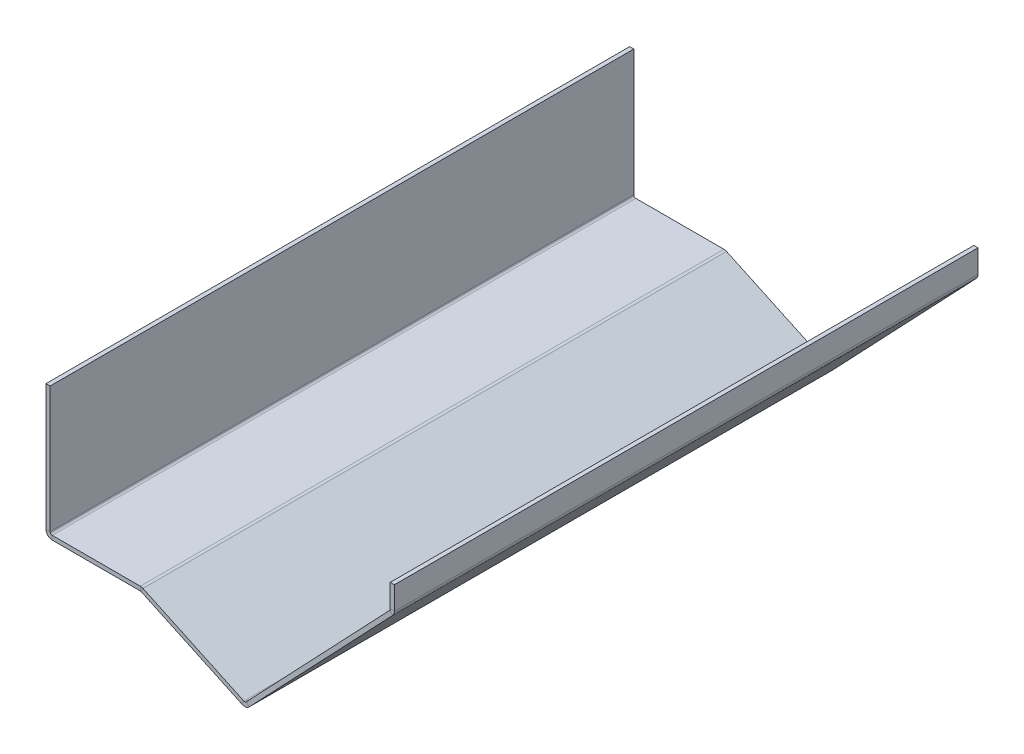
ISO-10303-21;
HEADER;
FILE_DESCRIPTION(('STEP AP214'),'2;1');
FILE_NAME('part.step','',(''),(''),'','','');
FILE_SCHEMA(('AUTOMOTIVE_DESIGN { 1 0 10303 214 1 1 1 1 }'));
ENDSEC;
DATA;
#1=APPLICATION_CONTEXT('core data for automotive mechanical design processes');
#2=APPLICATION_PROTOCOL_DEFINITION('international standard','automotive_design',2000,#1);
#3=PRODUCT_CONTEXT('',#1,'mechanical');
#4=PRODUCT('Part','Part','',(#3));
#5=PRODUCT_RELATED_PRODUCT_CATEGORY('part','',(#4));
#6=PRODUCT_DEFINITION_FORMATION('','',#4);
#7=PRODUCT_DEFINITION_CONTEXT('part definition',#1,'design');
#8=PRODUCT_DEFINITION('design','',#6,#7);
#9=PRODUCT_DEFINITION_SHAPE('','',#8);
#10=(LENGTH_UNIT() NAMED_UNIT(*) SI_UNIT(.MILLI.,.METRE.));
#11=(NAMED_UNIT(*) PLANE_ANGLE_UNIT() SI_UNIT($,.RADIAN.));
#12=(NAMED_UNIT(*) SI_UNIT($,.STERADIAN.) SOLID_ANGLE_UNIT());
#13=UNCERTAINTY_MEASURE_WITH_UNIT(LENGTH_MEASURE(1.E-05),#10,'distance_accuracy_value','');
#14=(GEOMETRIC_REPRESENTATION_CONTEXT(3) GLOBAL_UNCERTAINTY_ASSIGNED_CONTEXT((#13)) GLOBAL_UNIT_ASSIGNED_CONTEXT((#10,
#11,#12)) REPRESENTATION_CONTEXT('',''));
#15=CARTESIAN_POINT('',(0.,0.,0.));
#16=DIRECTION('',(0.,0.,1.));
#17=DIRECTION('',(1.,0.,0.));
#18=AXIS2_PLACEMENT_3D('',#15,#16,#17);
#19=CARTESIAN_POINT('',(1.,0.,281.5));
#20=DIRECTION('',(0.,0.,1.));
#21=DIRECTION('',(1.,0.,0.));
#22=AXIS2_PLACEMENT_3D('',#19,#20,#21);
#23=PLANE('',#22);
#24=DIRECTION('',(0.,-1.,0.));
#25=VECTOR('',#24,1.);
#26=CARTESIAN_POINT('',(1.,0.,281.5));
#27=LINE('',#26,#25);
#28=CARTESIAN_POINT('',(1.,0.,281.5));
#29=VERTEX_POINT('',#28);
#30=CARTESIAN_POINT('',(1.,-2.,281.5));
#31=VERTEX_POINT('',#30);
#32=EDGE_CURVE('E11',#29,#31,#27,.T.);
#33=ORIENTED_EDGE('',*,*,#32,.F.);
#34=CARTESIAN_POINT('',(1.,1.,281.5));
#35=DIRECTION('',(0.,0.,-1.));
#36=DIRECTION('',(-1.,0.,0.));
#37=AXIS2_PLACEMENT_3D('',#34,#35,#36);
#38=CIRCLE('',#37,1.);
#39=CARTESIAN_POINT('',(0.,1.,281.5));
#40=VERTEX_POINT('',#39);
#41=EDGE_CURVE('E364',#40,#29,#38,.F.);
#42=ORIENTED_EDGE('',*,*,#41,.F.);
#43=DIRECTION('',(1.,0.,0.));
#44=VECTOR('',#43,1.);
#45=CARTESIAN_POINT('',(-2.,1.,281.5));
#46=LINE('',#45,#44);
#47=CARTESIAN_POINT('',(-2.,1.,281.5));
#48=VERTEX_POINT('',#47);
#49=EDGE_CURVE('E43',#48,#40,#46,.T.);
#50=ORIENTED_EDGE('',*,*,#49,.F.);
#51=CARTESIAN_POINT('',(1.,1.,281.5));
#52=DIRECTION('',(0.,0.,1.));
#53=DIRECTION('',(1.,0.,0.));
#54=AXIS2_PLACEMENT_3D('',#51,#52,#53);
#55=CIRCLE('',#54,3.);
#56=EDGE_CURVE('E377',#48,#31,#55,.T.);
#57=ORIENTED_EDGE('',*,*,#56,.T.);
#58=EDGE_LOOP('',(#33,#42,#50,#57));
#59=FACE_BOUND('',#58,.T.);
#60=ADVANCED_FACE('F35',(#59),#23,.T.);
#61=CARTESIAN_POINT('',(-2.,1.,281.5));
#62=DIRECTION('',(0.,0.,1.));
#63=DIRECTION('',(1.,0.,0.));
#64=AXIS2_PLACEMENT_3D('',#61,#62,#63);
#65=PLANE('',#64);
#66=DIRECTION('',(1.,0.,0.));
#67=VECTOR('',#66,1.);
#68=CARTESIAN_POINT('',(0.,0.,281.5));
#69=LINE('',#68,#67);
#70=CARTESIAN_POINT('',(43.4847709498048,0.,281.5));
#71=VERTEX_POINT('',#70);
#72=EDGE_CURVE('E368',#29,#71,#69,.T.);
#73=ORIENTED_EDGE('',*,*,#72,.F.);
#74=ORIENTED_EDGE('',*,*,#32,.T.);
#75=DIRECTION('',(1.,0.,0.));
#76=VECTOR('',#75,1.);
#77=CARTESIAN_POINT('',(0.,-2.,281.5));
#78=LINE('',#77,#76);
#79=CARTESIAN_POINT('',(43.4847709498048,-2.,281.5));
#80=VERTEX_POINT('',#79);
#81=EDGE_CURVE('E379',#31,#80,#78,.T.);
#82=ORIENTED_EDGE('',*,*,#81,.T.);
#83=DIRECTION('',(0.,1.,0.));
#84=VECTOR('',#83,1.);
#85=CARTESIAN_POINT('',(43.4847709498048,-2.,281.5));
#86=LINE('',#85,#84);
#87=EDGE_CURVE('E338',#80,#71,#86,.T.);
#88=ORIENTED_EDGE('',*,*,#87,.T.);
#89=EDGE_LOOP('',(#73,#74,#82,#88));
#90=FACE_BOUND('',#89,.T.);
#91=ADVANCED_FACE('F448',(#90),#65,.T.);
#92=CARTESIAN_POINT('',(0.,1.,0.));
#93=DIRECTION('',(0.,0.,-1.));
#94=DIRECTION('',(-1.,0.,0.));
#95=AXIS2_PLACEMENT_3D('',#92,#93,#94);
#96=PLANE('',#95);
#97=DIRECTION('',(-1.,0.,0.));
#98=VECTOR('',#97,1.);
#99=CARTESIAN_POINT('',(0.,1.,0.));
#100=LINE('',#99,#98);
#101=CARTESIAN_POINT('',(0.,1.,0.));
#102=VERTEX_POINT('',#101);
#103=CARTESIAN_POINT('',(-2.,1.,0.));
#104=VERTEX_POINT('',#103);
#105=EDGE_CURVE('E344',#102,#104,#100,.T.);
#106=ORIENTED_EDGE('',*,*,#105,.F.);
#107=CARTESIAN_POINT('',(1.,1.,0.));
#108=DIRECTION('',(0.,0.,-1.));
#109=DIRECTION('',(-1.,0.,0.));
#110=AXIS2_PLACEMENT_3D('',#107,#108,#109);
#111=CIRCLE('',#110,1.);
#112=CARTESIAN_POINT('',(1.,0.,0.));
#113=VERTEX_POINT('',#112);
#114=EDGE_CURVE('E248',#102,#113,#111,.F.);
#115=ORIENTED_EDGE('',*,*,#114,.T.);
#116=DIRECTION('',(0.,1.,0.));
#117=VECTOR('',#116,1.);
#118=CARTESIAN_POINT('',(1.,-2.,0.));
#119=LINE('',#118,#117);
#120=CARTESIAN_POINT('',(1.,-2.,0.));
#121=VERTEX_POINT('',#120);
#122=EDGE_CURVE('E342',#121,#113,#119,.T.);
#123=ORIENTED_EDGE('',*,*,#122,.F.);
#124=CARTESIAN_POINT('',(1.,1.,0.));
#125=DIRECTION('',(0.,0.,1.));
#126=DIRECTION('',(1.,0.,0.));
#127=AXIS2_PLACEMENT_3D('',#124,#125,#126);
#128=CIRCLE('',#127,3.);
#129=EDGE_CURVE('E260',#104,#121,#128,.T.);
#130=ORIENTED_EDGE('',*,*,#129,.F.);
#131=EDGE_LOOP('',(#106,#115,#123,#130));
#132=FACE_BOUND('',#131,.T.);
#133=ADVANCED_FACE('F490',(#132),#96,.T.);
#134=CARTESIAN_POINT('',(1.,-2.,0.));
#135=DIRECTION('',(0.,0.,-1.));
#136=DIRECTION('',(-1.,0.,0.));
#137=AXIS2_PLACEMENT_3D('',#134,#135,#136);
#138=PLANE('',#137);
#139=DIRECTION('',(0.,-1.,0.));
#140=VECTOR('',#139,1.);
#141=CARTESIAN_POINT('',(0.,61.8874884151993,0.));
#142=LINE('',#141,#140);
#143=CARTESIAN_POINT('',(0.,61.8874884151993,0.));
#144=VERTEX_POINT('',#143);
#145=EDGE_CURVE('E251',#144,#102,#142,.T.);
#146=ORIENTED_EDGE('',*,*,#145,.T.);
#147=ORIENTED_EDGE('',*,*,#105,.T.);
#148=DIRECTION('',(0.,1.,0.));
#149=VECTOR('',#148,1.);
#150=CARTESIAN_POINT('',(-2.,61.8874884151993,0.));
#151=LINE('',#150,#149);
#152=CARTESIAN_POINT('',(-2.,61.8874884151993,0.));
#153=VERTEX_POINT('',#152);
#154=EDGE_CURVE('E257',#153,#104,#151,.F.);
#155=ORIENTED_EDGE('',*,*,#154,.F.);
#156=DIRECTION('',(1.,0.,0.));
#157=VECTOR('',#156,1.);
#158=CARTESIAN_POINT('',(-2.,61.8874884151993,0.));
#159=LINE('',#158,#157);
#160=EDGE_CURVE('E254',#153,#144,#159,.T.);
#161=ORIENTED_EDGE('',*,*,#160,.T.);
#162=EDGE_LOOP('',(#146,#147,#155,#161));
#163=FACE_BOUND('',#162,.T.);
#164=ADVANCED_FACE('F494',(#163),#138,.T.);
#165=CARTESIAN_POINT('',(44.7526361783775,-0.281081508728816,281.5));
#166=DIRECTION('',(0.,0.,1.));
#167=DIRECTION('',(1.,0.,0.));
#168=AXIS2_PLACEMENT_3D('',#165,#166,#167);
#169=PLANE('',#168);
#170=DIRECTION('',(-0.422621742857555,-0.906306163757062,0.));
#171=VECTOR('',#170,1.);
#172=CARTESIAN_POINT('',(44.7526361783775,-0.281081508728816,281.5));
#173=LINE('',#172,#171);
#174=CARTESIAN_POINT('',(44.7526361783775,-0.281081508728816,281.5));
#175=VERTEX_POINT('',#174);
#176=CARTESIAN_POINT('',(43.9073926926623,-2.09369383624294,281.5));
#177=VERTEX_POINT('',#176);
#178=EDGE_CURVE('E340',#175,#177,#173,.T.);
#179=ORIENTED_EDGE('',*,*,#178,.F.);
#180=CARTESIAN_POINT('',(43.4847709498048,-3.,281.5));
#181=DIRECTION('',(0.,0.,1.));
#182=DIRECTION('',(1.,0.,0.));
#183=AXIS2_PLACEMENT_3D('',#180,#181,#182);
#184=CIRCLE('',#183,3.);
#185=EDGE_CURVE('E438',#71,#175,#184,.F.);
#186=ORIENTED_EDGE('',*,*,#185,.F.);
#187=ORIENTED_EDGE('',*,*,#87,.F.);
#188=CARTESIAN_POINT('',(43.4847709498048,-3.,281.5));
#189=DIRECTION('',(0.,0.,1.));
#190=DIRECTION('',(1.,0.,0.));
#191=AXIS2_PLACEMENT_3D('',#188,#189,#190);
#192=CIRCLE('',#191,1.);
#193=EDGE_CURVE('E382',#80,#177,#192,.F.);
#194=ORIENTED_EDGE('',*,*,#193,.T.);
#195=EDGE_LOOP('',(#179,#186,#187,#194));
#196=FACE_BOUND('',#195,.T.);
#197=ADVANCED_FACE('F455',(#196),#169,.T.);
#198=CARTESIAN_POINT('',(43.4847709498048,-2.,281.5));
#199=DIRECTION('',(0.,0.,1.));
#200=DIRECTION('',(1.,0.,0.));
#201=AXIS2_PLACEMENT_3D('',#198,#199,#200);
#202=PLANE('',#201);
#203=DIRECTION('',(0.906306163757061,-0.422621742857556,0.));
#204=VECTOR('',#203,1.);
#205=CARTESIAN_POINT('',(44.1498609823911,0.,281.5));
#206=LINE('',#205,#204);
#207=CARTESIAN_POINT('',(93.4389456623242,-22.9841081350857,281.5));
#208=VERTEX_POINT('',#207);
#209=EDGE_CURVE('E435',#175,#208,#206,.T.);
#210=ORIENTED_EDGE('',*,*,#209,.F.);
#211=ORIENTED_EDGE('',*,*,#178,.T.);
#212=DIRECTION('',(0.906306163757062,-0.422621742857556,0.));
#213=VECTOR('',#212,1.);
#214=CARTESIAN_POINT('',(43.304617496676,-1.81261232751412,281.5));
#215=LINE('',#214,#213);
#216=CARTESIAN_POINT('',(92.5937021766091,-24.7967204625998,281.5));
#217=VERTEX_POINT('',#216);
#218=EDGE_CURVE('E202',#177,#217,#215,.T.);
#219=ORIENTED_EDGE('',*,*,#218,.T.);
#220=DIRECTION('',(0.422621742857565,0.906306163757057,0.));
#221=VECTOR('',#220,1.);
#222=CARTESIAN_POINT('',(92.5937021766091,-24.7967204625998,281.5));
#223=LINE('',#222,#221);
#224=EDGE_CURVE('E193',#217,#208,#223,.T.);
#225=ORIENTED_EDGE('',*,*,#224,.T.);
#226=EDGE_LOOP('',(#210,#211,#219,#225));
#227=FACE_BOUND('',#226,.T.);
#228=ADVANCED_FACE('F388',(#227),#202,.T.);
#229=CARTESIAN_POINT('',(43.4847709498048,0.,0.));
#230=DIRECTION('',(0.,0.,-1.));
#231=DIRECTION('',(-1.,0.,0.));
#232=AXIS2_PLACEMENT_3D('',#229,#230,#231);
#233=PLANE('',#232);
#234=DIRECTION('',(0.,-1.,0.));
#235=VECTOR('',#234,1.);
#236=CARTESIAN_POINT('',(43.4847709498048,0.,0.));
#237=LINE('',#236,#235);
#238=CARTESIAN_POINT('',(43.4847709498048,0.,0.));
#239=VERTEX_POINT('',#238);
#240=CARTESIAN_POINT('',(43.4847709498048,-2.,0.));
#241=VERTEX_POINT('',#240);
#242=EDGE_CURVE('E336',#239,#241,#237,.T.);
#243=ORIENTED_EDGE('',*,*,#242,.F.);
#244=CARTESIAN_POINT('',(43.4847709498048,-3.,0.));
#245=DIRECTION('',(0.,0.,1.));
#246=DIRECTION('',(1.,0.,0.));
#247=AXIS2_PLACEMENT_3D('',#244,#245,#246);
#248=CIRCLE('',#247,3.);
#249=CARTESIAN_POINT('',(44.7526361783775,-0.281081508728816,0.));
#250=VERTEX_POINT('',#249);
#251=EDGE_CURVE('E242',#239,#250,#248,.F.);
#252=ORIENTED_EDGE('',*,*,#251,.T.);
#253=DIRECTION('',(0.422621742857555,0.906306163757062,0.));
#254=VECTOR('',#253,1.);
#255=CARTESIAN_POINT('',(43.9073926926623,-2.09369383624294,0.));
#256=LINE('',#255,#254);
#257=CARTESIAN_POINT('',(43.9073926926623,-2.09369383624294,0.));
#258=VERTEX_POINT('',#257);
#259=EDGE_CURVE('E192',#258,#250,#256,.T.);
#260=ORIENTED_EDGE('',*,*,#259,.F.);
#261=CARTESIAN_POINT('',(43.4847709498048,-3.,0.));
#262=DIRECTION('',(0.,0.,1.));
#263=DIRECTION('',(1.,0.,0.));
#264=AXIS2_PLACEMENT_3D('',#261,#262,#263);
#265=CIRCLE('',#264,1.);
#266=EDGE_CURVE('E266',#241,#258,#265,.F.);
#267=ORIENTED_EDGE('',*,*,#266,.F.);
#268=EDGE_LOOP('',(#243,#252,#260,#267));
#269=FACE_BOUND('',#268,.T.);
#270=ADVANCED_FACE('F464',(#269),#233,.T.);
#271=CARTESIAN_POINT('',(43.9073926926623,-2.09369383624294,0.));
#272=DIRECTION('',(0.,0.,-1.));
#273=DIRECTION('',(-1.,0.,0.));
#274=AXIS2_PLACEMENT_3D('',#271,#272,#273);
#275=PLANE('',#274);
#276=DIRECTION('',(1.,0.,0.));
#277=VECTOR('',#276,1.);
#278=CARTESIAN_POINT('',(0.,0.,0.));
#279=LINE('',#278,#277);
#280=EDGE_CURVE('E245',#113,#239,#279,.T.);
#281=ORIENTED_EDGE('',*,*,#280,.T.);
#282=ORIENTED_EDGE('',*,*,#242,.T.);
#283=DIRECTION('',(1.,0.,0.));
#284=VECTOR('',#283,1.);
#285=CARTESIAN_POINT('',(0.,-2.,0.));
#286=LINE('',#285,#284);
#287=EDGE_CURVE('E263',#121,#241,#286,.T.);
#288=ORIENTED_EDGE('',*,*,#287,.F.);
#289=ORIENTED_EDGE('',*,*,#122,.T.);
#290=EDGE_LOOP('',(#281,#282,#288,#289));
#291=FACE_BOUND('',#290,.T.);
#292=ADVANCED_FACE('F468',(#291),#275,.T.);
#293=CARTESIAN_POINT('',(94.5865103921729,-22.7666108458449,281.5));
#294=DIRECTION('',(0.,0.,1.));
#295=DIRECTION('',(1.,0.,0.));
#296=AXIS2_PLACEMENT_3D('',#293,#294,#295);
#297=PLANE('',#296);
#298=DIRECTION('',(0.72494298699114,-0.688808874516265,0.));
#299=VECTOR('',#298,1.);
#300=CARTESIAN_POINT('',(94.5865103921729,-22.7666108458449,281.5));
#301=LINE('',#300,#299);
#302=CARTESIAN_POINT('',(94.5865103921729,-22.7666108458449,281.5));
#303=VERTEX_POINT('',#302);
#304=CARTESIAN_POINT('',(96.0363963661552,-24.1442285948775,281.5));
#305=VERTEX_POINT('',#304);
#306=EDGE_CURVE('E180',#303,#305,#301,.T.);
#307=ORIENTED_EDGE('',*,*,#306,.F.);
#308=CARTESIAN_POINT('',(93.8615674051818,-22.0778019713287,281.5));
#309=DIRECTION('',(0.,0.,-1.));
#310=DIRECTION('',(-1.,0.,0.));
#311=AXIS2_PLACEMENT_3D('',#308,#309,#310);
#312=CIRCLE('',#311,1.);
#313=EDGE_CURVE('E400',#208,#303,#312,.F.);
#314=ORIENTED_EDGE('',*,*,#313,.F.);
#315=ORIENTED_EDGE('',*,*,#224,.F.);
#316=CARTESIAN_POINT('',(93.8615674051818,-22.0778019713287,281.5));
#317=DIRECTION('',(0.,0.,1.));
#318=DIRECTION('',(1.,0.,0.));
#319=AXIS2_PLACEMENT_3D('',#316,#317,#318);
#320=CIRCLE('',#319,3.);
#321=EDGE_CURVE('E196',#217,#305,#320,.T.);
#322=ORIENTED_EDGE('',*,*,#321,.T.);
#323=EDGE_LOOP('',(#307,#314,#315,#322));
#324=FACE_BOUND('',#323,.T.);
#325=ADVANCED_FACE('F198',(#324),#297,.T.);
#326=CARTESIAN_POINT('',(92.5937021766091,-24.7967204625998,281.5));
#327=DIRECTION('',(0.,0.,1.));
#328=DIRECTION('',(1.,0.,0.));
#329=AXIS2_PLACEMENT_3D('',#326,#327,#328);
#330=PLANE('',#329);
#331=DIRECTION('',(0.688808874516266,0.724942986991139,0.));
#332=VECTOR('',#331,1.);
#333=CARTESIAN_POINT('',(94.0909644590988,-23.2881525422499,281.5));
#334=LINE('',#333,#332);
#335=CARTESIAN_POINT('',(163.766193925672,50.0421584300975,281.5));
#336=VERTEX_POINT('',#335);
#337=EDGE_CURVE('E187',#303,#336,#334,.T.);
#338=ORIENTED_EDGE('',*,*,#337,.F.);
#339=ORIENTED_EDGE('',*,*,#306,.T.);
#340=DIRECTION('',(0.688808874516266,0.724942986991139,0.));
#341=VECTOR('',#340,1.);
#342=CARTESIAN_POINT('',(95.5408504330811,-24.6657702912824,281.5));
#343=LINE('',#342,#341);
#344=CARTESIAN_POINT('',(165.216079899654,48.664540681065,281.5));
#345=VERTEX_POINT('',#344);
#346=EDGE_CURVE('E184',#305,#345,#343,.T.);
#347=ORIENTED_EDGE('',*,*,#346,.T.);
#348=DIRECTION('',(-0.724942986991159,0.688808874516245,0.));
#349=VECTOR('',#348,1.);
#350=CARTESIAN_POINT('',(165.216079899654,48.664540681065,281.5));
#351=LINE('',#350,#349);
#352=EDGE_CURVE('E327',#345,#336,#351,.T.);
#353=ORIENTED_EDGE('',*,*,#352,.T.);
#354=EDGE_LOOP('',(#338,#339,#347,#353));
#355=FACE_BOUND('',#354,.T.);
#356=ADVANCED_FACE('F182',(#355),#330,.T.);
#357=CARTESIAN_POINT('',(93.4389456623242,-22.9841081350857,0.));
#358=DIRECTION('',(0.,0.,-1.));
#359=DIRECTION('',(-1.,0.,0.));
#360=AXIS2_PLACEMENT_3D('',#357,#358,#359);
#361=PLANE('',#360);
#362=DIRECTION('',(-0.422621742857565,-0.906306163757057,0.));
#363=VECTOR('',#362,1.);
#364=CARTESIAN_POINT('',(93.4389456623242,-22.9841081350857,0.));
#365=LINE('',#364,#363);
#366=CARTESIAN_POINT('',(93.4389456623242,-22.9841081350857,0.));
#367=VERTEX_POINT('',#366);
#368=CARTESIAN_POINT('',(92.5937021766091,-24.7967204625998,0.));
#369=VERTEX_POINT('',#368);
#370=EDGE_CURVE('E332',#367,#369,#365,.T.);
#371=ORIENTED_EDGE('',*,*,#370,.F.);
#372=CARTESIAN_POINT('',(93.8615674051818,-22.0778019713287,0.));
#373=DIRECTION('',(0.,0.,-1.));
#374=DIRECTION('',(-1.,0.,0.));
#375=AXIS2_PLACEMENT_3D('',#372,#373,#374);
#376=CIRCLE('',#375,1.);
#377=CARTESIAN_POINT('',(94.5865103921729,-22.7666108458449,0.));
#378=VERTEX_POINT('',#377);
#379=EDGE_CURVE('E236',#367,#378,#376,.F.);
#380=ORIENTED_EDGE('',*,*,#379,.T.);
#381=DIRECTION('',(-0.72494298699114,0.688808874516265,0.));
#382=VECTOR('',#381,1.);
#383=CARTESIAN_POINT('',(96.0363963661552,-24.1442285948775,0.));
#384=LINE('',#383,#382);
#385=CARTESIAN_POINT('',(96.0363963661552,-24.1442285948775,0.));
#386=VERTEX_POINT('',#385);
#387=EDGE_CURVE('E330',#386,#378,#384,.T.);
#388=ORIENTED_EDGE('',*,*,#387,.F.);
#389=CARTESIAN_POINT('',(93.8615674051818,-22.0778019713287,0.));
#390=DIRECTION('',(0.,0.,1.));
#391=DIRECTION('',(1.,0.,0.));
#392=AXIS2_PLACEMENT_3D('',#389,#390,#391);
#393=CIRCLE('',#392,3.);
#394=EDGE_CURVE('E209',#369,#386,#393,.T.);
#395=ORIENTED_EDGE('',*,*,#394,.F.);
#396=EDGE_LOOP('',(#371,#380,#388,#395));
#397=FACE_BOUND('',#396,.T.);
#398=ADVANCED_FACE('F394',(#397),#361,.T.);
#399=CARTESIAN_POINT('',(96.0363963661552,-24.1442285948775,0.));
#400=DIRECTION('',(0.,0.,-1.));
#401=DIRECTION('',(-1.,0.,0.));
#402=AXIS2_PLACEMENT_3D('',#399,#400,#401);
#403=PLANE('',#402);
#404=DIRECTION('',(0.906306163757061,-0.422621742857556,0.));
#405=VECTOR('',#404,1.);
#406=CARTESIAN_POINT('',(44.1498609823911,0.,0.));
#407=LINE('',#406,#405);
#408=EDGE_CURVE('E239',#250,#367,#407,.T.);
#409=ORIENTED_EDGE('',*,*,#408,.T.);
#410=ORIENTED_EDGE('',*,*,#370,.T.);
#411=DIRECTION('',(0.906306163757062,-0.422621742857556,0.));
#412=VECTOR('',#411,1.);
#413=CARTESIAN_POINT('',(43.304617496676,-1.81261232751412,0.));
#414=LINE('',#413,#412);
#415=EDGE_CURVE('E269',#258,#369,#414,.T.);
#416=ORIENTED_EDGE('',*,*,#415,.F.);
#417=ORIENTED_EDGE('',*,*,#259,.T.);
#418=EDGE_LOOP('',(#409,#410,#416,#417));
#419=FACE_BOUND('',#418,.T.);
#420=ADVANCED_FACE('F474',(#419),#403,.T.);
#421=CARTESIAN_POINT('',(164.041250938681,50.7309673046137,281.5));
#422=DIRECTION('',(0.,0.,1.));
#423=DIRECTION('',(1.,0.,0.));
#424=AXIS2_PLACEMENT_3D('',#421,#422,#423);
#425=PLANE('',#424);
#426=DIRECTION('',(1.,0.,0.));
#427=VECTOR('',#426,1.);
#428=CARTESIAN_POINT('',(164.041250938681,50.7309673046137,281.5));
#429=LINE('',#428,#427);
#430=CARTESIAN_POINT('',(164.041250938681,50.7309673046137,281.5));
#431=VERTEX_POINT('',#430);
#432=CARTESIAN_POINT('',(166.041250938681,50.7309673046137,281.5));
#433=VERTEX_POINT('',#432);
#434=EDGE_CURVE('E51',#431,#433,#429,.T.);
#435=ORIENTED_EDGE('',*,*,#434,.F.);
#436=CARTESIAN_POINT('',(163.041250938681,50.7309673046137,281.5));
#437=DIRECTION('',(0.,0.,-1.));
#438=DIRECTION('',(-1.,0.,0.));
#439=AXIS2_PLACEMENT_3D('',#436,#437,#438);
#440=CIRCLE('',#439,1.);
#441=EDGE_CURVE('E428',#336,#431,#440,.F.);
#442=ORIENTED_EDGE('',*,*,#441,.F.);
#443=ORIENTED_EDGE('',*,*,#352,.F.);
#444=CARTESIAN_POINT('',(163.041250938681,50.7309673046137,281.5));
#445=DIRECTION('',(0.,0.,1.));
#446=DIRECTION('',(1.,0.,0.));
#447=AXIS2_PLACEMENT_3D('',#444,#445,#446);
#448=CIRCLE('',#447,3.);
#449=EDGE_CURVE('E217',#345,#433,#448,.T.);
#450=ORIENTED_EDGE('',*,*,#449,.T.);
#451=EDGE_LOOP('',(#435,#442,#443,#450));
#452=FACE_BOUND('',#451,.T.);
#453=ADVANCED_FACE('F476',(#452),#425,.T.);
#454=CARTESIAN_POINT('',(165.216079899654,48.664540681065,281.5));
#455=DIRECTION('',(0.,0.,1.));
#456=DIRECTION('',(1.,0.,0.));
#457=AXIS2_PLACEMENT_3D('',#454,#455,#456);
#458=PLANE('',#457);
#459=DIRECTION('',(0.,1.,0.));
#460=VECTOR('',#459,1.);
#461=CARTESIAN_POINT('',(164.041250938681,50.3316446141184,281.5));
#462=LINE('',#461,#460);
#463=CARTESIAN_POINT('',(164.041250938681,61.8874884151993,281.5));
#464=VERTEX_POINT('',#463);
#465=EDGE_CURVE('E426',#431,#464,#462,.T.);
#466=ORIENTED_EDGE('',*,*,#465,.F.);
#467=ORIENTED_EDGE('',*,*,#434,.T.);
#468=DIRECTION('',(0.,1.,0.));
#469=VECTOR('',#468,1.);
#470=CARTESIAN_POINT('',(166.041250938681,50.3316446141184,281.5));
#471=LINE('',#470,#469);
#472=CARTESIAN_POINT('',(166.041250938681,61.8874884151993,281.5));
#473=VERTEX_POINT('',#472);
#474=EDGE_CURVE('E129',#433,#473,#471,.T.);
#475=ORIENTED_EDGE('',*,*,#474,.T.);
#476=DIRECTION('',(1.,0.,0.));
#477=VECTOR('',#476,1.);
#478=CARTESIAN_POINT('',(164.041250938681,61.8874884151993,281.5));
#479=LINE('',#478,#477);
#480=EDGE_CURVE('E424',#464,#473,#479,.T.);
#481=ORIENTED_EDGE('',*,*,#480,.F.);
#482=EDGE_LOOP('',(#466,#467,#475,#481));
#483=FACE_BOUND('',#482,.T.);
#484=ADVANCED_FACE('F482',(#483),#458,.T.);
#485=CARTESIAN_POINT('',(163.766193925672,50.0421584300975,0.));
#486=DIRECTION('',(0.,0.,-1.));
#487=DIRECTION('',(-1.,0.,0.));
#488=AXIS2_PLACEMENT_3D('',#485,#486,#487);
#489=PLANE('',#488);
#490=DIRECTION('',(0.724942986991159,-0.688808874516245,0.));
#491=VECTOR('',#490,1.);
#492=CARTESIAN_POINT('',(163.766193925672,50.0421584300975,0.));
#493=LINE('',#492,#491);
#494=CARTESIAN_POINT('',(163.766193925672,50.0421584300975,0.));
#495=VERTEX_POINT('',#494);
#496=CARTESIAN_POINT('',(165.216079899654,48.664540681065,0.));
#497=VERTEX_POINT('',#496);
#498=EDGE_CURVE('E116',#495,#497,#493,.T.);
#499=ORIENTED_EDGE('',*,*,#498,.F.);
#500=CARTESIAN_POINT('',(163.041250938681,50.7309673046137,0.));
#501=DIRECTION('',(0.,0.,-1.));
#502=DIRECTION('',(-1.,0.,0.));
#503=AXIS2_PLACEMENT_3D('',#500,#501,#502);
#504=CIRCLE('',#503,1.);
#505=CARTESIAN_POINT('',(164.041250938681,50.7309673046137,0.));
#506=VERTEX_POINT('',#505);
#507=EDGE_CURVE('E232',#495,#506,#504,.F.);
#508=ORIENTED_EDGE('',*,*,#507,.T.);
#509=DIRECTION('',(-1.,0.,0.));
#510=VECTOR('',#509,1.);
#511=CARTESIAN_POINT('',(166.041250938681,50.7309673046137,0.));
#512=LINE('',#511,#510);
#513=CARTESIAN_POINT('',(166.041250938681,50.7309673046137,0.));
#514=VERTEX_POINT('',#513);
#515=EDGE_CURVE('E123',#514,#506,#512,.T.);
#516=ORIENTED_EDGE('',*,*,#515,.F.);
#517=CARTESIAN_POINT('',(163.041250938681,50.7309673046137,0.));
#518=DIRECTION('',(0.,0.,1.));
#519=DIRECTION('',(1.,0.,0.));
#520=AXIS2_PLACEMENT_3D('',#517,#518,#519);
#521=CIRCLE('',#520,3.);
#522=EDGE_CURVE('E275',#497,#514,#521,.T.);
#523=ORIENTED_EDGE('',*,*,#522,.F.);
#524=EDGE_LOOP('',(#499,#508,#516,#523));
#525=FACE_BOUND('',#524,.T.);
#526=ADVANCED_FACE('F411',(#525),#489,.T.);
#527=CARTESIAN_POINT('',(166.041250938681,50.7309673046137,0.));
#528=DIRECTION('',(0.,0.,-1.));
#529=DIRECTION('',(-1.,0.,0.));
#530=AXIS2_PLACEMENT_3D('',#527,#528,#529);
#531=PLANE('',#530);
#532=DIRECTION('',(0.688808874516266,0.724942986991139,0.));
#533=VECTOR('',#532,1.);
#534=CARTESIAN_POINT('',(94.0909644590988,-23.2881525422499,0.));
#535=LINE('',#534,#533);
#536=EDGE_CURVE('E234',#378,#495,#535,.T.);
#537=ORIENTED_EDGE('',*,*,#536,.T.);
#538=ORIENTED_EDGE('',*,*,#498,.T.);
#539=DIRECTION('',(0.688808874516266,0.724942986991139,0.));
#540=VECTOR('',#539,1.);
#541=CARTESIAN_POINT('',(95.5408504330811,-24.6657702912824,0.));
#542=LINE('',#541,#540);
#543=EDGE_CURVE('E273',#386,#497,#542,.T.);
#544=ORIENTED_EDGE('',*,*,#543,.F.);
#545=ORIENTED_EDGE('',*,*,#387,.T.);
#546=EDGE_LOOP('',(#537,#538,#544,#545));
#547=FACE_BOUND('',#546,.T.);
#548=ADVANCED_FACE('F396',(#547),#531,.T.);
#549=CARTESIAN_POINT('',(166.041250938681,50.3316446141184,281.5));
#550=DIRECTION('',(-1.,0.,0.));
#551=DIRECTION('',(0.,0.,1.));
#552=AXIS2_PLACEMENT_3D('',#549,#550,#551);
#553=PLANE('',#552);
#554=DIRECTION('',(0.,1.,0.));
#555=VECTOR('',#554,1.);
#556=CARTESIAN_POINT('',(166.041250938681,50.3316446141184,0.));
#557=LINE('',#556,#555);
#558=CARTESIAN_POINT('',(166.041250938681,61.8874884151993,0.));
#559=VERTEX_POINT('',#558);
#560=EDGE_CURVE('E223',#514,#559,#557,.T.);
#561=ORIENTED_EDGE('',*,*,#560,.T.);
#562=DIRECTION('',(0.,0.,-1.));
#563=VECTOR('',#562,1.);
#564=CARTESIAN_POINT('',(166.041250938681,61.8874884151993,281.5));
#565=LINE('',#564,#563);
#566=EDGE_CURVE('E323',#473,#559,#565,.T.);
#567=ORIENTED_EDGE('',*,*,#566,.F.);
#568=ORIENTED_EDGE('',*,*,#474,.F.);
#569=DIRECTION('',(0.,0.,-1.));
#570=VECTOR('',#569,1.);
#571=CARTESIAN_POINT('',(166.041250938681,50.7309673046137,281.5));
#572=LINE('',#571,#570);
#573=EDGE_CURVE('E219',#433,#514,#572,.T.);
#574=ORIENTED_EDGE('',*,*,#573,.T.);
#575=EDGE_LOOP('',(#561,#567,#568,#574));
#576=FACE_BOUND('',#575,.T.);
#577=ADVANCED_FACE('F417',(#576),#553,.F.);
#578=CARTESIAN_POINT('',(164.041250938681,61.8874884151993,281.5));
#579=DIRECTION('',(0.,1.,0.));
#580=DIRECTION('',(0.,0.,1.));
#581=AXIS2_PLACEMENT_3D('',#578,#579,#580);
#582=PLANE('',#581);
#583=DIRECTION('',(1.,0.,0.));
#584=VECTOR('',#583,1.);
#585=CARTESIAN_POINT('',(164.041250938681,61.8874884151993,0.));
#586=LINE('',#585,#584);
#587=CARTESIAN_POINT('',(164.041250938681,61.8874884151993,0.));
#588=VERTEX_POINT('',#587);
#589=EDGE_CURVE('E226',#588,#559,#586,.T.);
#590=ORIENTED_EDGE('',*,*,#589,.F.);
#591=DIRECTION('',(0.,0.,-1.));
#592=VECTOR('',#591,1.);
#593=CARTESIAN_POINT('',(164.041250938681,61.8874884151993,281.5));
#594=LINE('',#593,#592);
#595=EDGE_CURVE('E321',#464,#588,#594,.T.);
#596=ORIENTED_EDGE('',*,*,#595,.F.);
#597=ORIENTED_EDGE('',*,*,#480,.T.);
#598=ORIENTED_EDGE('',*,*,#566,.T.);
#599=EDGE_LOOP('',(#590,#596,#597,#598));
#600=FACE_BOUND('',#599,.T.);
#601=ADVANCED_FACE('F422',(#600),#582,.T.);
#602=CARTESIAN_POINT('',(164.041250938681,50.3316446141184,281.5));
#603=DIRECTION('',(-1.,0.,0.));
#604=DIRECTION('',(0.,0.,1.));
#605=AXIS2_PLACEMENT_3D('',#602,#603,#604);
#606=PLANE('',#605);
#607=DIRECTION('',(0.,1.,0.));
#608=VECTOR('',#607,1.);
#609=CARTESIAN_POINT('',(164.041250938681,50.3316446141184,0.));
#610=LINE('',#609,#608);
#611=EDGE_CURVE('E229',#506,#588,#610,.T.);
#612=ORIENTED_EDGE('',*,*,#611,.F.);
#613=DIRECTION('',(0.,0.,-1.));
#614=VECTOR('',#613,1.);
#615=CARTESIAN_POINT('',(164.041250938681,50.7309673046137,281.5));
#616=LINE('',#615,#614);
#617=EDGE_CURVE('E318',#431,#506,#616,.T.);
#618=ORIENTED_EDGE('',*,*,#617,.F.);
#619=ORIENTED_EDGE('',*,*,#465,.T.);
#620=ORIENTED_EDGE('',*,*,#595,.T.);
#621=EDGE_LOOP('',(#612,#618,#619,#620));
#622=FACE_BOUND('',#621,.T.);
#623=ADVANCED_FACE('F578',(#622),#606,.T.);
#624=CARTESIAN_POINT('',(163.041250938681,50.7309673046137,281.5));
#625=DIRECTION('',(0.,0.,-1.));
#626=DIRECTION('',(-1.,0.,0.));
#627=AXIS2_PLACEMENT_3D('',#624,#625,#626);
#628=CYLINDRICAL_SURFACE('',#627,1.);
#629=ORIENTED_EDGE('',*,*,#507,.F.);
#630=DIRECTION('',(0.,0.,-1.));
#631=VECTOR('',#630,1.);
#632=CARTESIAN_POINT('',(163.766193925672,50.0421584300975,281.5));
#633=LINE('',#632,#631);
#634=EDGE_CURVE('E315',#336,#495,#633,.T.);
#635=ORIENTED_EDGE('',*,*,#634,.F.);
#636=ORIENTED_EDGE('',*,*,#441,.T.);
#637=ORIENTED_EDGE('',*,*,#617,.T.);
#638=EDGE_LOOP('',(#629,#635,#636,#637));
#639=FACE_BOUND('',#638,.T.);
#640=ADVANCED_FACE('F408',(#639),#628,.F.);
#641=CARTESIAN_POINT('',(94.0909644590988,-23.2881525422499,281.5));
#642=DIRECTION('',(-0.724942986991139,0.688808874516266,0.));
#643=DIRECTION('',(-0.688808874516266,-0.724942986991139,0.));
#644=AXIS2_PLACEMENT_3D('',#641,#642,#643);
#645=PLANE('',#644);
#646=ORIENTED_EDGE('',*,*,#536,.F.);
#647=DIRECTION('',(0.,0.,-1.));
#648=VECTOR('',#647,1.);
#649=CARTESIAN_POINT('',(94.5865103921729,-22.7666108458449,281.5));
#650=LINE('',#649,#648);
#651=EDGE_CURVE('E312',#303,#378,#650,.T.);
#652=ORIENTED_EDGE('',*,*,#651,.F.);
#653=ORIENTED_EDGE('',*,*,#337,.T.);
#654=ORIENTED_EDGE('',*,*,#634,.T.);
#655=EDGE_LOOP('',(#646,#652,#653,#654));
#656=FACE_BOUND('',#655,.T.);
#657=ADVANCED_FACE('F402',(#656),#645,.T.);
#658=CARTESIAN_POINT('',(93.8615674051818,-22.0778019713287,281.5));
#659=DIRECTION('',(0.,0.,-1.));
#660=DIRECTION('',(-1.,0.,0.));
#661=AXIS2_PLACEMENT_3D('',#658,#659,#660);
#662=CYLINDRICAL_SURFACE('',#661,1.);
#663=ORIENTED_EDGE('',*,*,#379,.F.);
#664=DIRECTION('',(0.,0.,-1.));
#665=VECTOR('',#664,1.);
#666=CARTESIAN_POINT('',(93.4389456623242,-22.9841081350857,281.5));
#667=LINE('',#666,#665);
#668=EDGE_CURVE('E309',#208,#367,#667,.T.);
#669=ORIENTED_EDGE('',*,*,#668,.F.);
#670=ORIENTED_EDGE('',*,*,#313,.T.);
#671=ORIENTED_EDGE('',*,*,#651,.T.);
#672=EDGE_LOOP('',(#663,#669,#670,#671));
#673=FACE_BOUND('',#672,.T.);
#674=ADVANCED_FACE('F399',(#673),#662,.F.);
#675=CARTESIAN_POINT('',(44.1498609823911,0.,281.5));
#676=DIRECTION('',(0.422621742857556,0.906306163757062,0.));
#677=DIRECTION('',(-0.906306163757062,0.422621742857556,0.));
#678=AXIS2_PLACEMENT_3D('',#675,#676,#677);
#679=PLANE('',#678);
#680=ORIENTED_EDGE('',*,*,#408,.F.);
#681=DIRECTION('',(0.,0.,-1.));
#682=VECTOR('',#681,1.);
#683=CARTESIAN_POINT('',(44.7526361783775,-0.281081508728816,281.5));
#684=LINE('',#683,#682);
#685=EDGE_CURVE('E306',#175,#250,#684,.T.);
#686=ORIENTED_EDGE('',*,*,#685,.F.);
#687=ORIENTED_EDGE('',*,*,#209,.T.);
#688=ORIENTED_EDGE('',*,*,#668,.T.);
#689=EDGE_LOOP('',(#680,#686,#687,#688));
#690=FACE_BOUND('',#689,.T.);
#691=ADVANCED_FACE('F461',(#690),#679,.T.);
#692=CARTESIAN_POINT('',(43.4847709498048,-3.,281.5));
#693=DIRECTION('',(0.,0.,-1.));
#694=DIRECTION('',(-1.,0.,0.));
#695=AXIS2_PLACEMENT_3D('',#692,#693,#694);
#696=CYLINDRICAL_SURFACE('',#695,3.);
#697=ORIENTED_EDGE('',*,*,#251,.F.);
#698=DIRECTION('',(0.,0.,-1.));
#699=VECTOR('',#698,1.);
#700=CARTESIAN_POINT('',(43.4847709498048,0.,281.5));
#701=LINE('',#700,#699);
#702=EDGE_CURVE('E303',#71,#239,#701,.T.);
#703=ORIENTED_EDGE('',*,*,#702,.F.);
#704=ORIENTED_EDGE('',*,*,#185,.T.);
#705=ORIENTED_EDGE('',*,*,#685,.T.);
#706=EDGE_LOOP('',(#697,#703,#704,#705));
#707=FACE_BOUND('',#706,.T.);
#708=ADVANCED_FACE('F454',(#707),#696,.T.);
#709=CARTESIAN_POINT('',(0.,0.,281.5));
#710=DIRECTION('',(0.,1.,0.));
#711=DIRECTION('',(0.,0.,1.));
#712=AXIS2_PLACEMENT_3D('',#709,#710,#711);
#713=PLANE('',#712);
#714=ORIENTED_EDGE('',*,*,#280,.F.);
#715=DIRECTION('',(0.,0.,-1.));
#716=VECTOR('',#715,1.);
#717=CARTESIAN_POINT('',(1.,0.,281.5));
#718=LINE('',#717,#716);
#719=EDGE_CURVE('E300',#29,#113,#718,.T.);
#720=ORIENTED_EDGE('',*,*,#719,.F.);
#721=ORIENTED_EDGE('',*,*,#72,.T.);
#722=ORIENTED_EDGE('',*,*,#702,.T.);
#723=EDGE_LOOP('',(#714,#720,#721,#722));
#724=FACE_BOUND('',#723,.T.);
#725=ADVANCED_FACE('F444',(#724),#713,.T.);
#726=CARTESIAN_POINT('',(1.,1.,281.5));
#727=DIRECTION('',(0.,0.,-1.));
#728=DIRECTION('',(-1.,0.,0.));
#729=AXIS2_PLACEMENT_3D('',#726,#727,#728);
#730=CYLINDRICAL_SURFACE('',#729,1.);
#731=ORIENTED_EDGE('',*,*,#114,.F.);
#732=DIRECTION('',(0.,0.,-1.));
#733=VECTOR('',#732,1.);
#734=CARTESIAN_POINT('',(0.,1.,281.5));
#735=LINE('',#734,#733);
#736=EDGE_CURVE('E297',#40,#102,#735,.T.);
#737=ORIENTED_EDGE('',*,*,#736,.F.);
#738=ORIENTED_EDGE('',*,*,#41,.T.);
#739=ORIENTED_EDGE('',*,*,#719,.T.);
#740=EDGE_LOOP('',(#731,#737,#738,#739));
#741=FACE_BOUND('',#740,.T.);
#742=ADVANCED_FACE('F363',(#741),#730,.F.);
#743=CARTESIAN_POINT('',(0.,61.8874884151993,281.5));
#744=DIRECTION('',(1.,0.,0.));
#745=DIRECTION('',(0.,0.,-1.));
#746=AXIS2_PLACEMENT_3D('',#743,#744,#745);
#747=PLANE('',#746);
#748=ORIENTED_EDGE('',*,*,#145,.F.);
#749=DIRECTION('',(0.,0.,-1.));
#750=VECTOR('',#749,1.);
#751=CARTESIAN_POINT('',(0.,61.8874884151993,281.5));
#752=LINE('',#751,#750);
#753=CARTESIAN_POINT('',(0.,61.8874884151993,281.5));
#754=VERTEX_POINT('',#753);
#755=EDGE_CURVE('E295',#754,#144,#752,.T.);
#756=ORIENTED_EDGE('',*,*,#755,.F.);
#757=DIRECTION('',(0.,-1.,0.));
#758=VECTOR('',#757,1.);
#759=CARTESIAN_POINT('',(0.,61.8874884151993,281.5));
#760=LINE('',#759,#758);
#761=EDGE_CURVE('E352',#754,#40,#760,.T.);
#762=ORIENTED_EDGE('',*,*,#761,.T.);
#763=ORIENTED_EDGE('',*,*,#736,.T.);
#764=EDGE_LOOP('',(#748,#756,#762,#763));
#765=FACE_BOUND('',#764,.T.);
#766=ADVANCED_FACE('F370',(#765),#747,.T.);
#767=CARTESIAN_POINT('',(-2.,61.8874884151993,281.5));
#768=DIRECTION('',(0.,1.,0.));
#769=DIRECTION('',(0.,0.,1.));
#770=AXIS2_PLACEMENT_3D('',#767,#768,#769);
#771=PLANE('',#770);
#772=ORIENTED_EDGE('',*,*,#160,.F.);
#773=DIRECTION('',(0.,0.,-1.));
#774=VECTOR('',#773,1.);
#775=CARTESIAN_POINT('',(-2.,61.8874884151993,281.5));
#776=LINE('',#775,#774);
#777=CARTESIAN_POINT('',(-2.,61.8874884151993,281.5));
#778=VERTEX_POINT('',#777);
#779=EDGE_CURVE('E293',#778,#153,#776,.T.);
#780=ORIENTED_EDGE('',*,*,#779,.F.);
#781=DIRECTION('',(1.,0.,0.));
#782=VECTOR('',#781,1.);
#783=CARTESIAN_POINT('',(-2.,61.8874884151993,281.5));
#784=LINE('',#783,#782);
#785=EDGE_CURVE('E371',#778,#754,#784,.T.);
#786=ORIENTED_EDGE('',*,*,#785,.T.);
#787=ORIENTED_EDGE('',*,*,#755,.T.);
#788=EDGE_LOOP('',(#772,#780,#786,#787));
#789=FACE_BOUND('',#788,.T.);
#790=ADVANCED_FACE('F661',(#789),#771,.T.);
#791=CARTESIAN_POINT('',(-2.,61.8874884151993,281.5));
#792=DIRECTION('',(1.,0.,0.));
#793=DIRECTION('',(0.,0.,-1.));
#794=AXIS2_PLACEMENT_3D('',#791,#792,#793);
#795=PLANE('',#794);
#796=ORIENTED_EDGE('',*,*,#154,.T.);
#797=DIRECTION('',(0.,0.,-1.));
#798=VECTOR('',#797,1.);
#799=CARTESIAN_POINT('',(-2.,1.,281.5));
#800=LINE('',#799,#798);
#801=EDGE_CURVE('E290',#48,#104,#800,.T.);
#802=ORIENTED_EDGE('',*,*,#801,.F.);
#803=DIRECTION('',(0.,1.,0.));
#804=VECTOR('',#803,1.);
#805=CARTESIAN_POINT('',(-2.,61.8874884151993,281.5));
#806=LINE('',#805,#804);
#807=EDGE_CURVE('E355',#778,#48,#806,.F.);
#808=ORIENTED_EDGE('',*,*,#807,.F.);
#809=ORIENTED_EDGE('',*,*,#779,.T.);
#810=EDGE_LOOP('',(#796,#802,#808,#809));
#811=FACE_BOUND('',#810,.T.);
#812=ADVANCED_FACE('F671',(#811),#795,.F.);
#813=CARTESIAN_POINT('',(1.,1.,281.5));
#814=DIRECTION('',(0.,0.,-1.));
#815=DIRECTION('',(-1.,0.,0.));
#816=AXIS2_PLACEMENT_3D('',#813,#814,#815);
#817=CYLINDRICAL_SURFACE('',#816,3.);
#818=ORIENTED_EDGE('',*,*,#129,.T.);
#819=DIRECTION('',(0.,0.,-1.));
#820=VECTOR('',#819,1.);
#821=CARTESIAN_POINT('',(1.,-2.,281.5));
#822=LINE('',#821,#820);
#823=EDGE_CURVE('E287',#31,#121,#822,.T.);
#824=ORIENTED_EDGE('',*,*,#823,.F.);
#825=ORIENTED_EDGE('',*,*,#56,.F.);
#826=ORIENTED_EDGE('',*,*,#801,.T.);
#827=EDGE_LOOP('',(#818,#824,#825,#826));
#828=FACE_BOUND('',#827,.T.);
#829=ADVANCED_FACE('F682',(#828),#817,.T.);
#830=CARTESIAN_POINT('',(0.,-2.,281.5));
#831=DIRECTION('',(0.,1.,0.));
#832=DIRECTION('',(0.,0.,1.));
#833=AXIS2_PLACEMENT_3D('',#830,#831,#832);
#834=PLANE('',#833);
#835=ORIENTED_EDGE('',*,*,#287,.T.);
#836=DIRECTION('',(0.,0.,-1.));
#837=VECTOR('',#836,1.);
#838=CARTESIAN_POINT('',(43.4847709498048,-2.,281.5));
#839=LINE('',#838,#837);
#840=EDGE_CURVE('E284',#80,#241,#839,.T.);
#841=ORIENTED_EDGE('',*,*,#840,.F.);
#842=ORIENTED_EDGE('',*,*,#81,.F.);
#843=ORIENTED_EDGE('',*,*,#823,.T.);
#844=EDGE_LOOP('',(#835,#841,#842,#843));
#845=FACE_BOUND('',#844,.T.);
#846=ADVANCED_FACE('F470',(#845),#834,.F.);
#847=CARTESIAN_POINT('',(43.4847709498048,-3.,281.5));
#848=DIRECTION('',(0.,0.,-1.));
#849=DIRECTION('',(-1.,0.,0.));
#850=AXIS2_PLACEMENT_3D('',#847,#848,#849);
#851=CYLINDRICAL_SURFACE('',#850,1.);
#852=ORIENTED_EDGE('',*,*,#266,.T.);
#853=DIRECTION('',(0.,0.,-1.));
#854=VECTOR('',#853,1.);
#855=CARTESIAN_POINT('',(43.9073926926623,-2.09369383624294,281.5));
#856=LINE('',#855,#854);
#857=EDGE_CURVE('E281',#177,#258,#856,.T.);
#858=ORIENTED_EDGE('',*,*,#857,.F.);
#859=ORIENTED_EDGE('',*,*,#193,.F.);
#860=ORIENTED_EDGE('',*,*,#840,.T.);
#861=EDGE_LOOP('',(#852,#858,#859,#860));
#862=FACE_BOUND('',#861,.T.);
#863=ADVANCED_FACE('F473',(#862),#851,.F.);
#864=CARTESIAN_POINT('',(43.304617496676,-1.81261232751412,281.5));
#865=DIRECTION('',(0.422621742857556,0.906306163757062,0.));
#866=DIRECTION('',(-0.906306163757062,0.422621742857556,0.));
#867=AXIS2_PLACEMENT_3D('',#864,#865,#866);
#868=PLANE('',#867);
#869=ORIENTED_EDGE('',*,*,#415,.T.);
#870=DIRECTION('',(0.,0.,-1.));
#871=VECTOR('',#870,1.);
#872=CARTESIAN_POINT('',(92.5937021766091,-24.7967204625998,281.5));
#873=LINE('',#872,#871);
#874=EDGE_CURVE('E211',#217,#369,#873,.T.);
#875=ORIENTED_EDGE('',*,*,#874,.F.);
#876=ORIENTED_EDGE('',*,*,#218,.F.);
#877=ORIENTED_EDGE('',*,*,#857,.T.);
#878=EDGE_LOOP('',(#869,#875,#876,#877));
#879=FACE_BOUND('',#878,.T.);
#880=ADVANCED_FACE('F391',(#879),#868,.F.);
#881=CARTESIAN_POINT('',(93.8615674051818,-22.0778019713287,281.5));
#882=DIRECTION('',(0.,0.,-1.));
#883=DIRECTION('',(-1.,0.,0.));
#884=AXIS2_PLACEMENT_3D('',#881,#882,#883);
#885=CYLINDRICAL_SURFACE('',#884,3.);
#886=ORIENTED_EDGE('',*,*,#394,.T.);
#887=DIRECTION('',(0.,0.,-1.));
#888=VECTOR('',#887,1.);
#889=CARTESIAN_POINT('',(96.0363963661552,-24.1442285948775,281.5));
#890=LINE('',#889,#888);
#891=EDGE_CURVE('E206',#305,#386,#890,.T.);
#892=ORIENTED_EDGE('',*,*,#891,.F.);
#893=ORIENTED_EDGE('',*,*,#321,.F.);
#894=ORIENTED_EDGE('',*,*,#874,.T.);
#895=EDGE_LOOP('',(#886,#892,#893,#894));
#896=FACE_BOUND('',#895,.T.);
#897=ADVANCED_FACE('F207',(#896),#885,.T.);
#898=CARTESIAN_POINT('',(95.5408504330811,-24.6657702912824,281.5));
#899=DIRECTION('',(-0.724942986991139,0.688808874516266,0.));
#900=DIRECTION('',(-0.688808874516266,-0.724942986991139,0.));
#901=AXIS2_PLACEMENT_3D('',#898,#899,#900);
#902=PLANE('',#901);
#903=ORIENTED_EDGE('',*,*,#543,.T.);
#904=DIRECTION('',(0.,0.,-1.));
#905=VECTOR('',#904,1.);
#906=CARTESIAN_POINT('',(165.216079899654,48.664540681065,281.5));
#907=LINE('',#906,#905);
#908=EDGE_CURVE('E212',#345,#497,#907,.T.);
#909=ORIENTED_EDGE('',*,*,#908,.F.);
#910=ORIENTED_EDGE('',*,*,#346,.F.);
#911=ORIENTED_EDGE('',*,*,#891,.T.);
#912=EDGE_LOOP('',(#903,#909,#910,#911));
#913=FACE_BOUND('',#912,.T.);
#914=ADVANCED_FACE('F214',(#913),#902,.F.);
#915=CARTESIAN_POINT('',(163.041250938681,50.7309673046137,281.5));
#916=DIRECTION('',(0.,0.,-1.));
#917=DIRECTION('',(-1.,0.,0.));
#918=AXIS2_PLACEMENT_3D('',#915,#916,#917);
#919=CYLINDRICAL_SURFACE('',#918,3.);
#920=ORIENTED_EDGE('',*,*,#522,.T.);
#921=ORIENTED_EDGE('',*,*,#573,.F.);
#922=ORIENTED_EDGE('',*,*,#449,.F.);
#923=ORIENTED_EDGE('',*,*,#908,.T.);
#924=EDGE_LOOP('',(#920,#921,#922,#923));
#925=FACE_BOUND('',#924,.T.);
#926=ADVANCED_FACE('F414',(#925),#919,.T.);
#927=CARTESIAN_POINT('',(163.041250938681,50.7309673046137,281.5));
#928=DIRECTION('',(0.,0.,-1.));
#929=DIRECTION('',(-1.,0.,0.));
#930=AXIS2_PLACEMENT_3D('',#927,#928,#929);
#931=PLANE('',#930);
#932=ORIENTED_EDGE('',*,*,#807,.T.);
#933=ORIENTED_EDGE('',*,*,#49,.T.);
#934=ORIENTED_EDGE('',*,*,#761,.F.);
#935=ORIENTED_EDGE('',*,*,#785,.F.);
#936=EDGE_LOOP('',(#932,#933,#934,#935));
#937=FACE_BOUND('',#936,.T.);
#938=ADVANCED_FACE('F349',(#937),#931,.F.);
#939=CARTESIAN_POINT('',(163.041250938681,50.7309673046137,0.));
#940=DIRECTION('',(0.,0.,-1.));
#941=DIRECTION('',(-1.,0.,0.));
#942=AXIS2_PLACEMENT_3D('',#939,#940,#941);
#943=PLANE('',#942);
#944=ORIENTED_EDGE('',*,*,#560,.F.);
#945=ORIENTED_EDGE('',*,*,#515,.T.);
#946=ORIENTED_EDGE('',*,*,#611,.T.);
#947=ORIENTED_EDGE('',*,*,#589,.T.);
#948=EDGE_LOOP('',(#944,#945,#946,#947));
#949=FACE_BOUND('',#948,.T.);
#950=ADVANCED_FACE('F419',(#949),#943,.T.);
#951=CLOSED_SHELL('',(#60,#91,#133,#164,#197,#228,#270,#292,#325,#356,#398,#420,#453,#484,#526,
#548,#577,#601,#623,#640,#657,#674,#691,#708,#725,#742,#766,#790,#812,#829,#846,#863,#880,#897,
#914,#926,#938,#950));
#952=MANIFOLD_SOLID_BREP('B2',#951);
#953=ADVANCED_BREP_SHAPE_REPRESENTATION('',(#18,#952),#14);
#954=SHAPE_DEFINITION_REPRESENTATION(#9,#953);
ENDSEC;
END-ISO-10303-21;
